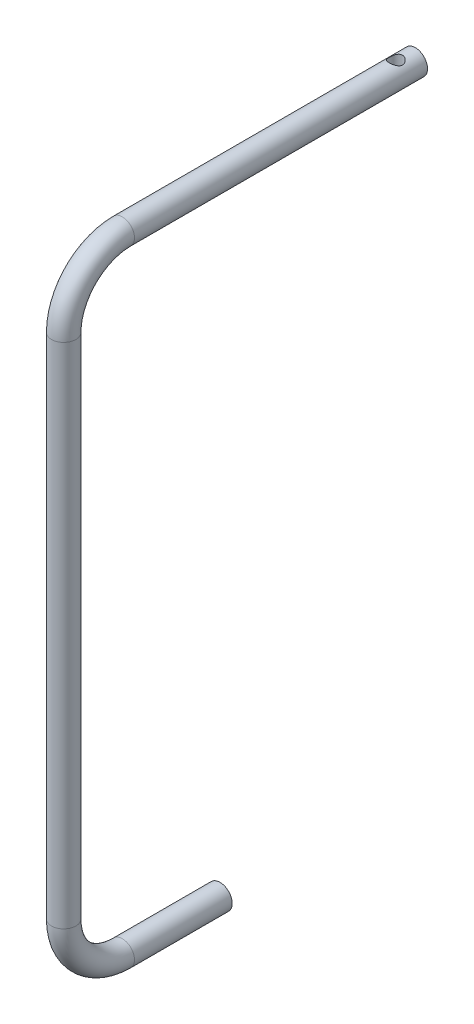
ISO-10303-21;
HEADER;
FILE_DESCRIPTION(('STEP AP214'),'2;1');
FILE_NAME('part.step','',(''),(''),'','','');
FILE_SCHEMA(('AUTOMOTIVE_DESIGN { 1 0 10303 214 1 1 1 1 }'));
ENDSEC;
DATA;
#1=APPLICATION_CONTEXT('core data for automotive mechanical design processes');
#2=APPLICATION_PROTOCOL_DEFINITION('international standard','automotive_design',2000,#1);
#3=PRODUCT_CONTEXT('',#1,'mechanical');
#4=PRODUCT('Part','Part','',(#3));
#5=PRODUCT_RELATED_PRODUCT_CATEGORY('part','',(#4));
#6=PRODUCT_DEFINITION_FORMATION('','',#4);
#7=PRODUCT_DEFINITION_CONTEXT('part definition',#1,'design');
#8=PRODUCT_DEFINITION('design','',#6,#7);
#9=PRODUCT_DEFINITION_SHAPE('','',#8);
#10=(LENGTH_UNIT() NAMED_UNIT(*) SI_UNIT(.MILLI.,.METRE.));
#11=(NAMED_UNIT(*) PLANE_ANGLE_UNIT() SI_UNIT($,.RADIAN.));
#12=(NAMED_UNIT(*) SI_UNIT($,.STERADIAN.) SOLID_ANGLE_UNIT());
#13=UNCERTAINTY_MEASURE_WITH_UNIT(LENGTH_MEASURE(1.E-05),#10,'distance_accuracy_value','');
#14=(GEOMETRIC_REPRESENTATION_CONTEXT(3) GLOBAL_UNCERTAINTY_ASSIGNED_CONTEXT((#13)) GLOBAL_UNIT_ASSIGNED_CONTEXT((#10,
#11,#12)) REPRESENTATION_CONTEXT('',''));
#15=CARTESIAN_POINT('',(0.,0.,0.));
#16=DIRECTION('',(0.,0.,1.));
#17=DIRECTION('',(1.,0.,0.));
#18=AXIS2_PLACEMENT_3D('',#15,#16,#17);
#19=CARTESIAN_POINT('',(0.,-203.2,95.25));
#20=DIRECTION('',(0.,0.,-1.));
#21=DIRECTION('',(-1.,0.,0.));
#22=AXIS2_PLACEMENT_3D('',#19,#20,#21);
#23=CYLINDRICAL_SURFACE('',#22,3.96875);
#24=CARTESIAN_POINT('',(0.,-203.2,95.25));
#25=DIRECTION('',(0.,0.,-1.));
#26=DIRECTION('',(1.,0.,0.));
#27=AXIS2_PLACEMENT_3D('',#24,#25,#26);
#28=CIRCLE('',#27,3.96875);
#29=CARTESIAN_POINT('',(0.,-207.16875,95.25));
#30=VERTEX_POINT('',#29);
#31=EDGE_CURVE('E43',#30,#30,#28,.T.);
#32=ORIENTED_EDGE('',*,*,#31,.T.);
#33=EDGE_LOOP('',(#32));
#34=FACE_BOUND('',#33,.T.);
#35=CARTESIAN_POINT('',(0.,-203.2,63.4999999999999));
#36=DIRECTION('',(0.,0.,-1.));
#37=DIRECTION('',(1.,0.,0.));
#38=AXIS2_PLACEMENT_3D('',#35,#36,#37);
#39=CIRCLE('',#38,3.96875);
#40=CARTESIAN_POINT('',(3.96875,-203.2,63.4999999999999));
#41=VERTEX_POINT('',#40);
#42=EDGE_CURVE('E10',#41,#41,#39,.T.);
#43=ORIENTED_EDGE('',*,*,#42,.F.);
#44=EDGE_LOOP('',(#43));
#45=FACE_BOUND('',#44,.T.);
#46=ADVANCED_FACE('F32',(#34,#45),#23,.T.);
#47=CARTESIAN_POINT('',(0.,-184.15,95.25));
#48=DIRECTION('',(1.,0.,0.));
#49=DIRECTION('',(0.,0.,-1.));
#50=AXIS2_PLACEMENT_3D('',#47,#48,#49);
#51=TOROIDAL_SURFACE('',#50,19.05,3.96875);
#52=CARTESIAN_POINT('',(0.,-184.15,114.3));
#53=DIRECTION('',(0.,-1.,0.));
#54=DIRECTION('',(1.,0.,0.));
#55=AXIS2_PLACEMENT_3D('',#52,#53,#54);
#56=CIRCLE('',#55,3.96875);
#57=CARTESIAN_POINT('',(0.,-184.15,118.26875));
#58=VERTEX_POINT('',#57);
#59=EDGE_CURVE('E48',#58,#58,#56,.T.);
#60=CARTESIAN_POINT('',(0.,-184.15,95.25));
#61=DIRECTION('',(1.,0.,0.));
#62=DIRECTION('',(0.,0.,-1.));
#63=AXIS2_PLACEMENT_3D('',#60,#61,#62);
#64=CIRCLE('',#63,23.01875);
#65=EDGE_CURVE('',#58,#30,#64,.T.);
#66=ORIENTED_EDGE('',*,*,#59,.T.);
#67=ORIENTED_EDGE('',*,*,#31,.F.);
#68=ORIENTED_EDGE('',*,*,#65,.T.);
#69=ORIENTED_EDGE('',*,*,#65,.F.);
#70=EDGE_LOOP('',(#66,#68,#67,#69));
#71=FACE_BOUND('',#70,.T.);
#72=ADVANCED_FACE('F74',(#71),#51,.T.);
#73=CARTESIAN_POINT('',(0.,-19.05,114.3));
#74=DIRECTION('',(0.,-1.,0.));
#75=DIRECTION('',(0.,0.,-1.));
#76=AXIS2_PLACEMENT_3D('',#73,#74,#75);
#77=CYLINDRICAL_SURFACE('',#76,3.96875);
#78=CARTESIAN_POINT('',(0.,-19.05,114.3));
#79=DIRECTION('',(0.,-1.,0.));
#80=DIRECTION('',(1.,0.,0.));
#81=AXIS2_PLACEMENT_3D('',#78,#79,#80);
#82=CIRCLE('',#81,3.96875);
#83=CARTESIAN_POINT('',(0.,-19.05,118.26875));
#84=VERTEX_POINT('',#83);
#85=EDGE_CURVE('E103',#84,#84,#82,.T.);
#86=ORIENTED_EDGE('',*,*,#85,.T.);
#87=EDGE_LOOP('',(#86));
#88=FACE_BOUND('',#87,.T.);
#89=ORIENTED_EDGE('',*,*,#59,.F.);
#90=EDGE_LOOP('',(#89));
#91=FACE_BOUND('',#90,.T.);
#92=ADVANCED_FACE('F79',(#88,#91),#77,.T.);
#93=CARTESIAN_POINT('',(0.,-19.05,95.25));
#94=DIRECTION('',(1.,0.,0.));
#95=DIRECTION('',(0.,0.,-1.));
#96=AXIS2_PLACEMENT_3D('',#93,#94,#95);
#97=TOROIDAL_SURFACE('',#96,19.05,3.96875);
#98=CARTESIAN_POINT('',(0.,0.,95.25));
#99=DIRECTION('',(0.,0.,1.));
#100=DIRECTION('',(1.,0.,0.));
#101=AXIS2_PLACEMENT_3D('',#98,#99,#100);
#102=CIRCLE('',#101,3.96875);
#103=CARTESIAN_POINT('',(0.,3.96874999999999,95.25));
#104=VERTEX_POINT('',#103);
#105=EDGE_CURVE('E100',#104,#104,#102,.T.);
#106=CARTESIAN_POINT('',(0.,-19.05,95.25));
#107=DIRECTION('',(1.,0.,0.));
#108=DIRECTION('',(0.,0.,-1.));
#109=AXIS2_PLACEMENT_3D('',#106,#107,#108);
#110=CIRCLE('',#109,23.01875);
#111=EDGE_CURVE('',#104,#84,#110,.T.);
#112=ORIENTED_EDGE('',*,*,#105,.T.);
#113=ORIENTED_EDGE('',*,*,#85,.F.);
#114=ORIENTED_EDGE('',*,*,#111,.T.);
#115=ORIENTED_EDGE('',*,*,#111,.F.);
#116=EDGE_LOOP('',(#112,#114,#113,#115));
#117=FACE_BOUND('',#116,.T.);
#118=ADVANCED_FACE('F87',(#117),#97,.T.);
#119=CARTESIAN_POINT('',(0.,0.,95.25));
#120=DIRECTION('',(0.,0.,-1.));
#121=DIRECTION('',(0.,1.,0.));
#122=AXIS2_PLACEMENT_3D('',#119,#120,#121);
#123=CYLINDRICAL_SURFACE('',#122,3.96875);
#124=CARTESIAN_POINT('',(0.,3.96875,8.50899999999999));
#125=CARTESIAN_POINT('',(-0.112267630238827,3.96874240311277,8.50899130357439));
#126=CARTESIAN_POINT('',(-0.224637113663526,3.96393689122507,8.50019152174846));
#127=CARTESIAN_POINT('',(-0.445974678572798,3.94518355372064,8.46541557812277));
#128=CARTESIAN_POINT('',(-0.554937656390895,3.93122264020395,8.43941482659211));
#129=CARTESIAN_POINT('',(-0.765943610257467,3.89560168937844,8.37159440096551));
#130=CARTESIAN_POINT('',(-0.868012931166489,3.8739731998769,8.32983950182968));
#131=CARTESIAN_POINT('',(-1.06349974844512,3.82493354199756,8.2320748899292));
#132=CARTESIAN_POINT('',(-1.15691699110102,3.7975222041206,8.17606475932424));
#133=CARTESIAN_POINT('',(-1.33957224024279,3.73716342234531,8.04710423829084));
#134=CARTESIAN_POINT('',(-1.42809699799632,3.70396658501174,7.97326250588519));
#135=CARTESIAN_POINT('',(-1.59218012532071,3.63645795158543,7.8126814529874));
#136=CARTESIAN_POINT('',(-1.66772665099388,3.60214517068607,7.72593048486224));
#137=CARTESIAN_POINT('',(-1.81101307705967,3.53244158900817,7.53211901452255));
#138=CARTESIAN_POINT('',(-1.8773106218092,3.49726270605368,7.42390883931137));
#139=CARTESIAN_POINT('',(-1.99051899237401,3.43410081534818,7.19573127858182));
#140=CARTESIAN_POINT('',(-2.03744503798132,3.40611216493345,7.07577321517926));
#141=CARTESIAN_POINT('',(-2.09034567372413,3.37369435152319,6.89353020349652));
#142=CARTESIAN_POINT('',(-2.10483589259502,3.36464561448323,6.83443081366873));
#143=CARTESIAN_POINT('',(-2.12881732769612,3.34952497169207,6.71486561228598));
#144=CARTESIAN_POINT('',(-2.13831145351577,3.34345133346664,6.65440061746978));
#145=CARTESIAN_POINT('',(-2.15212675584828,3.33457578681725,6.53269688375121));
#146=CARTESIAN_POINT('',(-2.15645262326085,3.33177091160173,6.4714588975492));
#147=CARTESIAN_POINT('',(-2.1598725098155,3.32955355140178,6.34879643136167));
#148=CARTESIAN_POINT('',(-2.15896721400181,3.33014062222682,6.28737197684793));
#149=CARTESIAN_POINT('',(-2.14944722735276,3.3363056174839,6.12190918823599));
#150=CARTESIAN_POINT('',(-2.13586709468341,3.34509753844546,6.01822328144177));
#151=CARTESIAN_POINT('',(-2.09424103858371,3.3713071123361,5.81499577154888));
#152=CARTESIAN_POINT('',(-2.06618881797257,3.38872852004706,5.71545599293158));
#153=CARTESIAN_POINT('',(-1.9960357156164,3.43052645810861,5.52048768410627));
#154=CARTESIAN_POINT('',(-1.95364027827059,3.45504711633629,5.42519715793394));
#155=CARTESIAN_POINT('',(-1.85625082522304,3.50833108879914,5.24259867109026));
#156=CARTESIAN_POINT('',(-1.80125131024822,3.53709625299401,5.1552942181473));
#157=CARTESIAN_POINT('',(-1.67038910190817,3.6009514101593,4.97700539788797));
#158=CARTESIAN_POINT('',(-1.59261856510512,3.63633369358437,4.88752060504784));
#159=CARTESIAN_POINT('',(-1.42319520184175,3.70592574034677,4.72217336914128));
#160=CARTESIAN_POINT('',(-1.33153332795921,3.74013472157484,4.64631987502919));
#161=CARTESIAN_POINT('',(-1.12957526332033,3.80618175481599,4.50570529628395));
#162=CARTESIAN_POINT('',(-1.01845995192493,3.8377260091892,4.44197079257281));
#163=CARTESIAN_POINT('',(-0.78495187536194,3.89219068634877,4.33465950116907));
#164=CARTESIAN_POINT('',(-0.66256964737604,3.9151190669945,4.2910641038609));
#165=CARTESIAN_POINT('',(-0.42204055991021,3.94793774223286,4.22935608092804));
#166=CARTESIAN_POINT('',(-0.304539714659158,3.95883339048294,4.20926819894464));
#167=CARTESIAN_POINT('',(-0.0673578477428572,3.96994952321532,4.18877686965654));
#168=CARTESIAN_POINT('',(0.0523217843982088,3.97017658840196,4.18836128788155));
#169=CARTESIAN_POINT('',(0.278287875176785,3.9604428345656,4.20629956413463));
#170=CARTESIAN_POINT('',(0.384764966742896,3.95144955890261,4.22287086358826));
#171=CARTESIAN_POINT('',(0.593158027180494,3.92557861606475,4.27132474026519));
#172=CARTESIAN_POINT('',(0.695073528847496,3.90870014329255,4.30320888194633));
#173=CARTESIAN_POINT('',(0.89429615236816,3.86804829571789,4.38193937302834));
#174=CARTESIAN_POINT('',(0.991439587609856,3.84412279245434,4.42911844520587));
#175=CARTESIAN_POINT('',(1.1766945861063,3.79152390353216,4.53667237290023));
#176=CARTESIAN_POINT('',(1.26480274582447,3.76284873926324,4.59705217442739));
#177=CARTESIAN_POINT('',(1.43984906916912,3.69964808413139,4.73692342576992));
#178=CARTESIAN_POINT('',(1.52558317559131,3.66482623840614,4.81778916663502));
#179=CARTESIAN_POINT('',(1.68290756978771,3.59530416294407,4.99245112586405));
#180=CARTESIAN_POINT('',(1.75448369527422,3.56060408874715,5.08626013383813));
#181=CARTESIAN_POINT('',(1.88663007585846,3.49249628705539,5.29264321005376));
#182=CARTESIAN_POINT('',(1.94599619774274,3.4593735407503,5.4060916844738));
#183=CARTESIAN_POINT('',(2.04421219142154,3.40226934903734,5.64364737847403));
#184=CARTESIAN_POINT('',(2.08309177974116,3.3782746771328,5.76773885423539));
#185=CARTESIAN_POINT('',(2.13535477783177,3.34546100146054,6.01030898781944));
#186=CARTESIAN_POINT('',(2.15085414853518,3.33539065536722,6.12815558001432));
#187=CARTESIAN_POINT('',(2.1621961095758,3.32805467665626,6.36515258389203));
#188=CARTESIAN_POINT('',(2.15805422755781,3.33077892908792,6.4843018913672));
#189=CARTESIAN_POINT('',(2.13228448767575,3.34731326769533,6.70390599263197));
#190=CARTESIAN_POINT('',(2.11301400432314,3.35962713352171,6.8047679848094));
#191=CARTESIAN_POINT('',(2.06083795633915,3.3918812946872,7.00161522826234));
#192=CARTESIAN_POINT('',(2.0279270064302,3.41182460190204,7.09759853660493));
#193=CARTESIAN_POINT('',(1.94718541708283,3.458575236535,7.28871275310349));
#194=CARTESIAN_POINT('',(1.89855034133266,3.48573386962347,7.38341483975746));
#195=CARTESIAN_POINT('',(1.78851874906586,3.54345013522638,7.56394929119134));
#196=CARTESIAN_POINT('',(1.72711540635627,3.57400958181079,7.64977687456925));
#197=CARTESIAN_POINT('',(1.58237308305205,3.64065014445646,7.82378837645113));
#198=CARTESIAN_POINT('',(1.49711717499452,3.67686290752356,7.91033743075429));
#199=CARTESIAN_POINT('',(1.31265050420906,3.74668825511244,8.06843209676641));
#200=CARTESIAN_POINT('',(1.21343017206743,3.78029903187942,8.13996733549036));
#201=CARTESIAN_POINT('',(0.999525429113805,3.84247875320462,8.26785715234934));
#202=CARTESIAN_POINT('',(0.884458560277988,3.87086030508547,8.32367569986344));
#203=CARTESIAN_POINT('',(0.704789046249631,3.90614892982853,8.39173131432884));
#204=CARTESIAN_POINT('',(0.643758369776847,3.91669385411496,8.41179739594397));
#205=CARTESIAN_POINT('',(0.519781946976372,3.93506264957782,8.44648325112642));
#206=CARTESIAN_POINT('',(0.456837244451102,3.94288797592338,8.46110593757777));
#207=CARTESIAN_POINT('',(0.32861642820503,3.95565427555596,8.48485537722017));
#208=CARTESIAN_POINT('',(0.263319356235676,3.96054911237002,8.49389428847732));
#209=CARTESIAN_POINT('',(0.132026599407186,3.96709920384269,8.50596914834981));
#210=CARTESIAN_POINT('',(0.0660309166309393,3.96875446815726,8.5090051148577));
#211=CARTESIAN_POINT('',(0.,3.96875,8.50899999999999));
#212=B_SPLINE_CURVE_WITH_KNOTS('',3,(#124,#125,#126,#127,#128,#129,#130,#131,#132,#133,#134,
#135,#136,#137,#138,#139,#140,#141,#142,#143,#144,#145,#146,#147,#148,#149,#150,#151,#152,#153,
#154,#155,#156,#157,#158,#159,#160,#161,#162,#163,#164,#165,#166,#167,#168,#169,#170,#171,#172,
#173,#174,#175,#176,#177,#178,#179,#180,#181,#182,#183,#184,#185,#186,#187,#188,#189,#190,#191,
#192,#193,#194,#195,#196,#197,#198,#199,#200,#201,#202,#203,#204,#205,#206,#207,#208,#209,#210,
#211),.UNSPECIFIED.,.T.,.F.,(4,2,2,2,2,2,2,2,2,2,2,2,2,2,2,2,2,2,2,2,2,2,2,2,2,2,2,2,2,2,2,2,2,
2,2,2,2,2,2,2,2,2,2,4),(0.,0.336546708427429,0.673575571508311,1.00923354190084,
1.34490135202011,1.70333685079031,2.06209773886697,2.45524630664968,2.84808539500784,
3.03240308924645,3.21661332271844,3.40065623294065,3.58467504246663,3.89786305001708,
4.21118744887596,4.53138206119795,4.85171664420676,5.22132431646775,5.59117375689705,
5.98479961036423,6.37806100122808,6.73514610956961,7.09201095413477,7.41491230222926,
7.73784664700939,8.06833922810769,8.3989558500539,8.76608878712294,9.13358713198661,
9.52824202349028,9.92232286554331,10.2779878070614,10.6333716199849,10.9422837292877,
11.2513179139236,11.5796814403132,11.9082209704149,12.2868376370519,12.6657150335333,
13.056273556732,13.2513271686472,13.4462762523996,13.6442189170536,13.8421609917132),.UNSPECIFIED.);
#213=CARTESIAN_POINT('',(0.,3.96875,8.50899999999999));
#214=VERTEX_POINT('',#213);
#215=EDGE_CURVE('E35',#214,#214,#212,.T.);
#216=ORIENTED_EDGE('',*,*,#215,.T.);
#217=EDGE_LOOP('',(#216));
#218=FACE_BOUND('',#217,.T.);
#219=CARTESIAN_POINT('',(0.,-3.96875,8.509));
#220=CARTESIAN_POINT('',(0.112267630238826,-3.96874240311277,8.5089913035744));
#221=CARTESIAN_POINT('',(0.224637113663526,-3.96393689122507,8.50019152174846));
#222=CARTESIAN_POINT('',(0.445974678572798,-3.94518355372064,8.46541557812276));
#223=CARTESIAN_POINT('',(0.554937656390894,-3.93122264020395,8.43941482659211));
#224=CARTESIAN_POINT('',(0.765943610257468,-3.89560168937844,8.37159440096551));
#225=CARTESIAN_POINT('',(0.86801293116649,-3.87397319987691,8.32983950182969));
#226=CARTESIAN_POINT('',(1.06349974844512,-3.82493354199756,8.2320748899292));
#227=CARTESIAN_POINT('',(1.15691699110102,-3.7975222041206,8.17606475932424));
#228=CARTESIAN_POINT('',(1.33957224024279,-3.73716342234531,8.04710423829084));
#229=CARTESIAN_POINT('',(1.42809699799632,-3.70396658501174,7.97326250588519));
#230=CARTESIAN_POINT('',(1.59218012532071,-3.63645795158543,7.8126814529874));
#231=CARTESIAN_POINT('',(1.66772665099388,-3.60214517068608,7.72593048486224));
#232=CARTESIAN_POINT('',(1.81101307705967,-3.53244158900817,7.53211901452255));
#233=CARTESIAN_POINT('',(1.8773106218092,-3.49726270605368,7.42390883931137));
#234=CARTESIAN_POINT('',(1.990518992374,-3.43410081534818,7.19573127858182));
#235=CARTESIAN_POINT('',(2.03744503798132,-3.40611216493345,7.07577321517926));
#236=CARTESIAN_POINT('',(2.09034567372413,-3.37369435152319,6.89353020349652));
#237=CARTESIAN_POINT('',(2.10483589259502,-3.36464561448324,6.83443081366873));
#238=CARTESIAN_POINT('',(2.12881732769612,-3.34952497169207,6.71486561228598));
#239=CARTESIAN_POINT('',(2.13831145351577,-3.34345133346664,6.65440061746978));
#240=CARTESIAN_POINT('',(2.15212675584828,-3.33457578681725,6.53269688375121));
#241=CARTESIAN_POINT('',(2.15645262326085,-3.33177091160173,6.4714588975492));
#242=CARTESIAN_POINT('',(2.1598725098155,-3.32955355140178,6.34879643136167));
#243=CARTESIAN_POINT('',(2.15896721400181,-3.33014062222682,6.28737197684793));
#244=CARTESIAN_POINT('',(2.14944722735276,-3.3363056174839,6.12190918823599));
#245=CARTESIAN_POINT('',(2.13586709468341,-3.34509753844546,6.01822328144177));
#246=CARTESIAN_POINT('',(2.09424103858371,-3.3713071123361,5.81499577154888));
#247=CARTESIAN_POINT('',(2.06618881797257,-3.38872852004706,5.71545599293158));
#248=CARTESIAN_POINT('',(1.9960357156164,-3.43052645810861,5.52048768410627));
#249=CARTESIAN_POINT('',(1.95364027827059,-3.45504711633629,5.42519715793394));
#250=CARTESIAN_POINT('',(1.85625082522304,-3.50833108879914,5.24259867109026));
#251=CARTESIAN_POINT('',(1.80125131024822,-3.53709625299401,5.1552942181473));
#252=CARTESIAN_POINT('',(1.67038910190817,-3.6009514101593,4.97700539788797));
#253=CARTESIAN_POINT('',(1.59261856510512,-3.63633369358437,4.88752060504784));
#254=CARTESIAN_POINT('',(1.42319520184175,-3.70592574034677,4.72217336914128));
#255=CARTESIAN_POINT('',(1.33153332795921,-3.74013472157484,4.64631987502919));
#256=CARTESIAN_POINT('',(1.12957526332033,-3.80618175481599,4.50570529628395));
#257=CARTESIAN_POINT('',(1.01845995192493,-3.8377260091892,4.44197079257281));
#258=CARTESIAN_POINT('',(0.78495187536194,-3.89219068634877,4.33465950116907));
#259=CARTESIAN_POINT('',(0.66256964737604,-3.9151190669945,4.2910641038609));
#260=CARTESIAN_POINT('',(0.42204055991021,-3.94793774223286,4.22935608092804));
#261=CARTESIAN_POINT('',(0.304539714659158,-3.95883339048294,4.20926819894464));
#262=CARTESIAN_POINT('',(0.0673578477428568,-3.96994952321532,4.18877686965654));
#263=CARTESIAN_POINT('',(-0.0523217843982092,-3.97017658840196,4.18836128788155));
#264=CARTESIAN_POINT('',(-0.278287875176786,-3.9604428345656,4.20629956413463));
#265=CARTESIAN_POINT('',(-0.384764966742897,-3.95144955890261,4.22287086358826));
#266=CARTESIAN_POINT('',(-0.593158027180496,-3.92557861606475,4.27132474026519));
#267=CARTESIAN_POINT('',(-0.695073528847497,-3.90870014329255,4.30320888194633));
#268=CARTESIAN_POINT('',(-0.89429615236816,-3.8680482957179,4.38193937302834));
#269=CARTESIAN_POINT('',(-0.991439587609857,-3.84412279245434,4.42911844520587));
#270=CARTESIAN_POINT('',(-1.1766945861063,-3.79152390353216,4.53667237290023));
#271=CARTESIAN_POINT('',(-1.26480274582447,-3.76284873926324,4.59705217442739));
#272=CARTESIAN_POINT('',(-1.43984906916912,-3.69964808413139,4.73692342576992));
#273=CARTESIAN_POINT('',(-1.52558317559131,-3.66482623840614,4.81778916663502));
#274=CARTESIAN_POINT('',(-1.68290756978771,-3.59530416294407,4.99245112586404));
#275=CARTESIAN_POINT('',(-1.75448369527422,-3.56060408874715,5.08626013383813));
#276=CARTESIAN_POINT('',(-1.88663007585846,-3.49249628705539,5.29264321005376));
#277=CARTESIAN_POINT('',(-1.94599619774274,-3.4593735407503,5.4060916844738));
#278=CARTESIAN_POINT('',(-2.04421219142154,-3.40226934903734,5.64364737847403));
#279=CARTESIAN_POINT('',(-2.08309177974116,-3.3782746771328,5.76773885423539));
#280=CARTESIAN_POINT('',(-2.13535477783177,-3.34546100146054,6.01030898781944));
#281=CARTESIAN_POINT('',(-2.15085414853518,-3.33539065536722,6.12815558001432));
#282=CARTESIAN_POINT('',(-2.1621961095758,-3.32805467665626,6.36515258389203));
#283=CARTESIAN_POINT('',(-2.15805422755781,-3.33077892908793,6.48430189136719));
#284=CARTESIAN_POINT('',(-2.13228448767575,-3.34731326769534,6.70390599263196));
#285=CARTESIAN_POINT('',(-2.11301400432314,-3.35962713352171,6.8047679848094));
#286=CARTESIAN_POINT('',(-2.06083795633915,-3.3918812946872,7.00161522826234));
#287=CARTESIAN_POINT('',(-2.0279270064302,-3.41182460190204,7.09759853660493));
#288=CARTESIAN_POINT('',(-1.94718541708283,-3.458575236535,7.28871275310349));
#289=CARTESIAN_POINT('',(-1.89855034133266,-3.48573386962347,7.38341483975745));
#290=CARTESIAN_POINT('',(-1.78851874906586,-3.54345013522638,7.56394929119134));
#291=CARTESIAN_POINT('',(-1.72711540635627,-3.57400958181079,7.64977687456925));
#292=CARTESIAN_POINT('',(-1.58237308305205,-3.64065014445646,7.82378837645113));
#293=CARTESIAN_POINT('',(-1.49711717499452,-3.67686290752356,7.91033743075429));
#294=CARTESIAN_POINT('',(-1.31265050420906,-3.74668825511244,8.06843209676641));
#295=CARTESIAN_POINT('',(-1.21343017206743,-3.78029903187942,8.13996733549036));
#296=CARTESIAN_POINT('',(-0.999525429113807,-3.84247875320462,8.26785715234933));
#297=CARTESIAN_POINT('',(-0.88445856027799,-3.87086030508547,8.32367569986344));
#298=CARTESIAN_POINT('',(-0.704789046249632,-3.90614892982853,8.39173131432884));
#299=CARTESIAN_POINT('',(-0.643758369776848,-3.91669385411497,8.41179739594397));
#300=CARTESIAN_POINT('',(-0.519781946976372,-3.93506264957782,8.44648325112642));
#301=CARTESIAN_POINT('',(-0.456837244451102,-3.94288797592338,8.46110593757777));
#302=CARTESIAN_POINT('',(-0.32861642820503,-3.95565427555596,8.48485537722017));
#303=CARTESIAN_POINT('',(-0.263319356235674,-3.96054911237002,8.49389428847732));
#304=CARTESIAN_POINT('',(-0.132026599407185,-3.96709920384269,8.50596914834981));
#305=CARTESIAN_POINT('',(-0.0660309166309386,-3.96875446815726,8.50900511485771));
#306=CARTESIAN_POINT('',(0.,-3.96875,8.509));
#307=B_SPLINE_CURVE_WITH_KNOTS('',3,(#219,#220,#221,#222,#223,#224,#225,#226,#227,#228,#229,
#230,#231,#232,#233,#234,#235,#236,#237,#238,#239,#240,#241,#242,#243,#244,#245,#246,#247,#248,
#249,#250,#251,#252,#253,#254,#255,#256,#257,#258,#259,#260,#261,#262,#263,#264,#265,#266,#267,
#268,#269,#270,#271,#272,#273,#274,#275,#276,#277,#278,#279,#280,#281,#282,#283,#284,#285,#286,
#287,#288,#289,#290,#291,#292,#293,#294,#295,#296,#297,#298,#299,#300,#301,#302,#303,#304,#305,
#306),.UNSPECIFIED.,.T.,.F.,(4,2,2,2,2,2,2,2,2,2,2,2,2,2,2,2,2,2,2,2,2,2,2,2,2,2,2,2,2,2,2,2,2,
2,2,2,2,2,2,2,2,2,2,4),(0.,0.336546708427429,0.673575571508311,1.00923354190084,
1.34490135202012,1.70333685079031,2.06209773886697,2.45524630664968,2.84808539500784,
3.03240308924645,3.21661332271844,3.40065623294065,3.58467504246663,3.89786305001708,
4.21118744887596,4.53138206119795,4.85171664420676,5.22132431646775,5.59117375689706,
5.98479961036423,6.37806100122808,6.73514610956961,7.09201095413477,7.41491230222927,
7.7378466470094,8.06833922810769,8.3989558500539,8.76608878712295,9.13358713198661,
9.52824202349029,9.92232286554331,10.2779878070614,10.6333716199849,10.9422837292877,
11.2513179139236,11.5796814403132,11.9082209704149,12.2868376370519,12.6657150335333,
13.056273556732,13.2513271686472,13.4462762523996,13.6442189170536,13.8421609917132),.UNSPECIFIED.);
#308=CARTESIAN_POINT('',(0.,-3.96875,8.509));
#309=VERTEX_POINT('',#308);
#310=EDGE_CURVE('E51',#309,#309,#307,.T.);
#311=ORIENTED_EDGE('',*,*,#310,.T.);
#312=EDGE_LOOP('',(#311));
#313=FACE_BOUND('',#312,.T.);
#314=ORIENTED_EDGE('',*,*,#105,.F.);
#315=EDGE_LOOP('',(#314));
#316=FACE_BOUND('',#315,.T.);
#317=CARTESIAN_POINT('',(0.,0.,0.));
#318=DIRECTION('',(0.,0.,1.));
#319=DIRECTION('',(1.,0.,0.));
#320=AXIS2_PLACEMENT_3D('',#317,#318,#319);
#321=CIRCLE('',#320,3.96875);
#322=CARTESIAN_POINT('',(3.96875,0.,0.));
#323=VERTEX_POINT('',#322);
#324=EDGE_CURVE('E105',#323,#323,#321,.T.);
#325=ORIENTED_EDGE('',*,*,#324,.T.);
#326=EDGE_LOOP('',(#325));
#327=FACE_BOUND('',#326,.T.);
#328=ADVANCED_FACE('F55',(#218,#313,#316,#327),#123,.T.);
#329=CARTESIAN_POINT('',(0.,-203.2,63.4999999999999));
#330=DIRECTION('',(0.,0.,-1.));
#331=DIRECTION('',(1.,0.,0.));
#332=AXIS2_PLACEMENT_3D('',#329,#330,#331);
#333=PLANE('',#332);
#334=ORIENTED_EDGE('',*,*,#42,.T.);
#335=EDGE_LOOP('',(#334));
#336=FACE_BOUND('',#335,.T.);
#337=ADVANCED_FACE('F65',(#336),#333,.T.);
#338=CARTESIAN_POINT('',(0.,0.,0.));
#339=DIRECTION('',(0.,0.,1.));
#340=DIRECTION('',(1.,0.,0.));
#341=AXIS2_PLACEMENT_3D('',#338,#339,#340);
#342=PLANE('',#341);
#343=ORIENTED_EDGE('',*,*,#324,.F.);
#344=EDGE_LOOP('',(#343));
#345=FACE_BOUND('',#344,.T.);
#346=ADVANCED_FACE('F63',(#345),#342,.F.);
#347=CARTESIAN_POINT('',(0.,-5.08,6.35));
#348=DIRECTION('',(0.,1.,0.));
#349=DIRECTION('',(0.,0.,1.));
#350=AXIS2_PLACEMENT_3D('',#347,#348,#349);
#351=CYLINDRICAL_SURFACE('',#350,2.159);
#352=ORIENTED_EDGE('',*,*,#310,.F.);
#353=EDGE_LOOP('',(#352));
#354=FACE_BOUND('',#353,.T.);
#355=ORIENTED_EDGE('',*,*,#215,.F.);
#356=EDGE_LOOP('',(#355));
#357=FACE_BOUND('',#356,.T.);
#358=ADVANCED_FACE('F59',(#354,#357),#351,.F.);
#359=CLOSED_SHELL('',(#46,#72,#92,#118,#328,#337,#346,#358));
#360=MANIFOLD_SOLID_BREP('B2',#359);
#361=ADVANCED_BREP_SHAPE_REPRESENTATION('',(#18,#360),#14);
#362=SHAPE_DEFINITION_REPRESENTATION(#9,#361);
ENDSEC;
END-ISO-10303-21;
